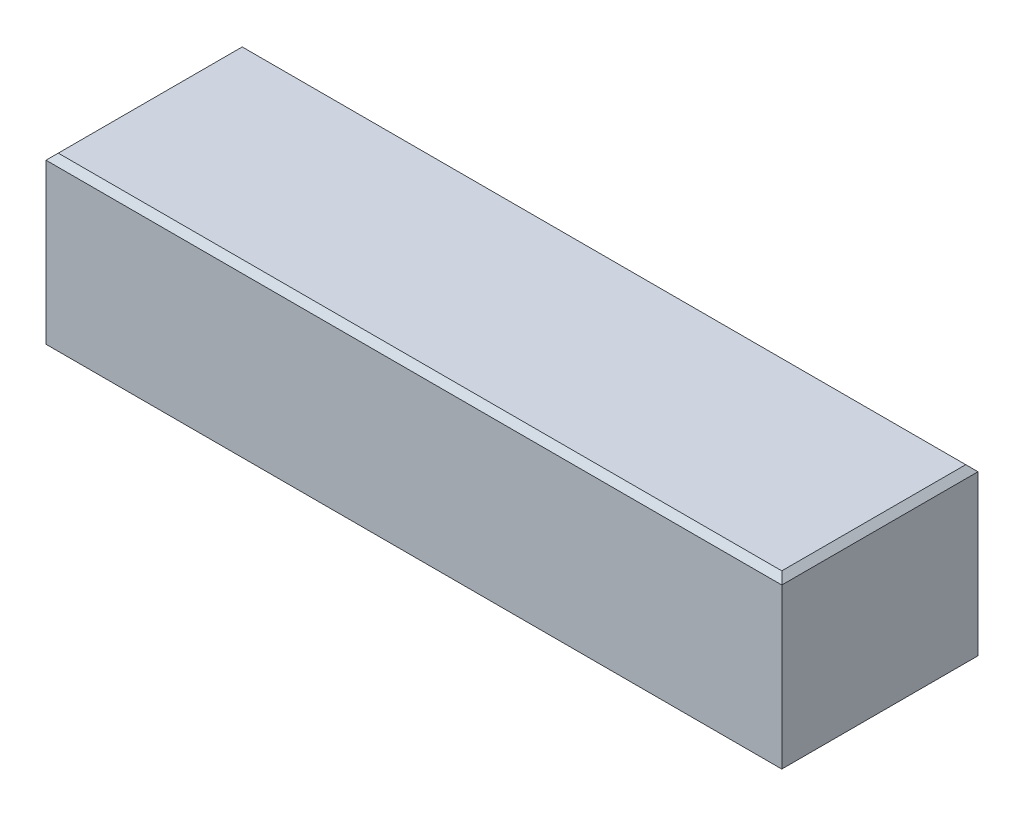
from build123d import *

# Parameters (mm, degrees)
ESQUISSE1_W          = 30
ESQUISSE1_H          = 8
BASE_EXTRUSION_DEPTH = 7
CHANFREIN1_SIZE      = 0.25


with BuildPart() as part:
    # Esquisse1 → Base-Extrusion (new body)
    with BuildSketch(Plane(origin=(0, 0, 0), x_dir=(1, 0, 0), z_dir=(0, 1, 0))):
        with Locations((15, 0)):
            Rectangle(ESQUISSE1_W, ESQUISSE1_H)
    extrude(amount=BASE_EXTRUSION_DEPTH)

    # Chanfrein1
    chanfrein1_edges = [part.edges().sort_by_distance(p)[0] for p in [
        (30, 7, 0),
        (15, 7, -4),
        (0, 7, 0),
        (15, 0, -4),
        (30, 0, 0),
        (15, 0, 4),
        (0, 0, 0),
        (15, 7, 4),
    ]]
    chamfer(chanfrein1_edges, length=CHANFREIN1_SIZE)


solid = part.part
